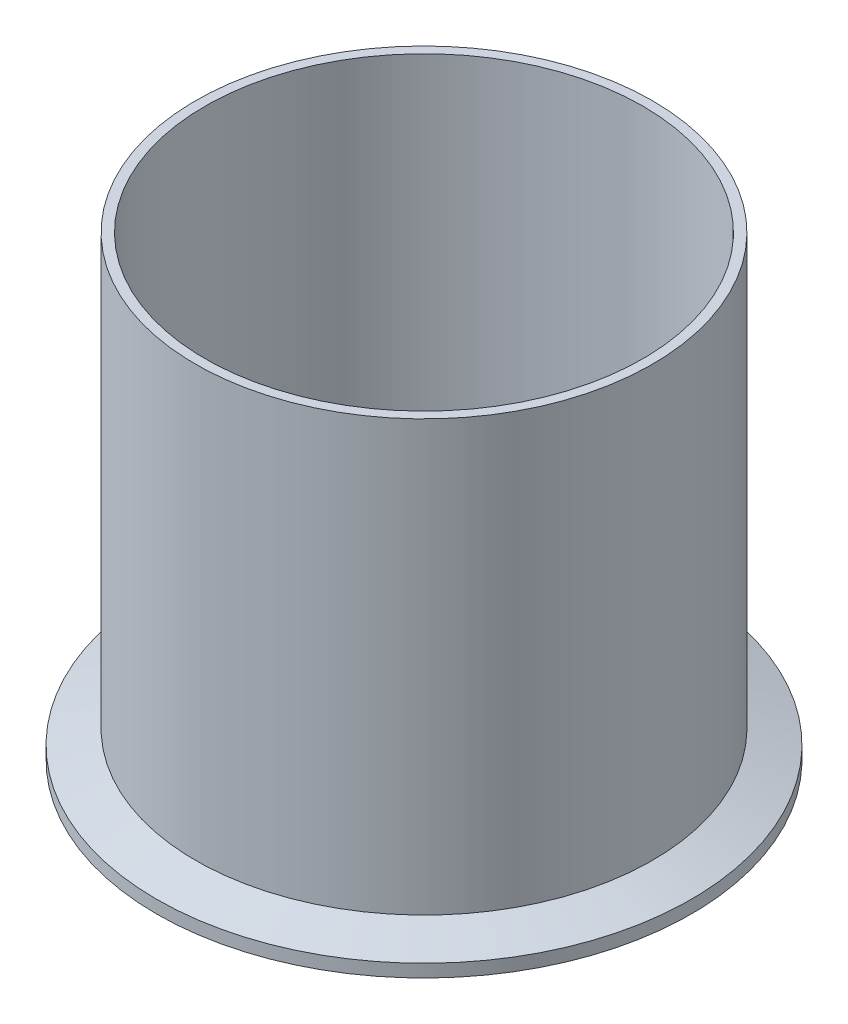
from build123d import *


with BuildPart() as part:
    # Sketch1 → Revolve2 (revolve)
    with BuildSketch(Plane.XY, mode=Mode.PRIVATE) as revolve2_sk:
        with BuildLine():
            Line((-48.6918, 0), (-48.6918, 101.6))
            Line((-48.6918, 101.6), (-50.8, 101.6))
            Line((-50.8, 101.6), (-50.8, 5.997291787))
            Line((-50.8, 5.997291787), (-59.4614, 2.8448))
            Line((-59.4614, 2.8448), (-59.4614, 0))
            Line((-59.4614, 0), (-56.618508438, 0))
            ThreePointArc((-56.618508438, 0), (-56.186311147, 0.129217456), (-55.895966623, 0.474458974))
            ThreePointArc((-55.895966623, 0.474458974), (-54.8005, 1.1938), (-53.705033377, 0.474458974))
            ThreePointArc((-53.705033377, 0.474458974), (-53.414688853, 0.129217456), (-52.982491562, 0))
            Line((-52.982491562, 0), (-48.6918, 0))
        make_face()
    revolve(revolve2_sk.sketch.rotate(Axis((0, 0, 0), (0, 1, 0)), 270), axis=Axis((0, 0, 0), (0, 1, 0)))


solid = part.part
